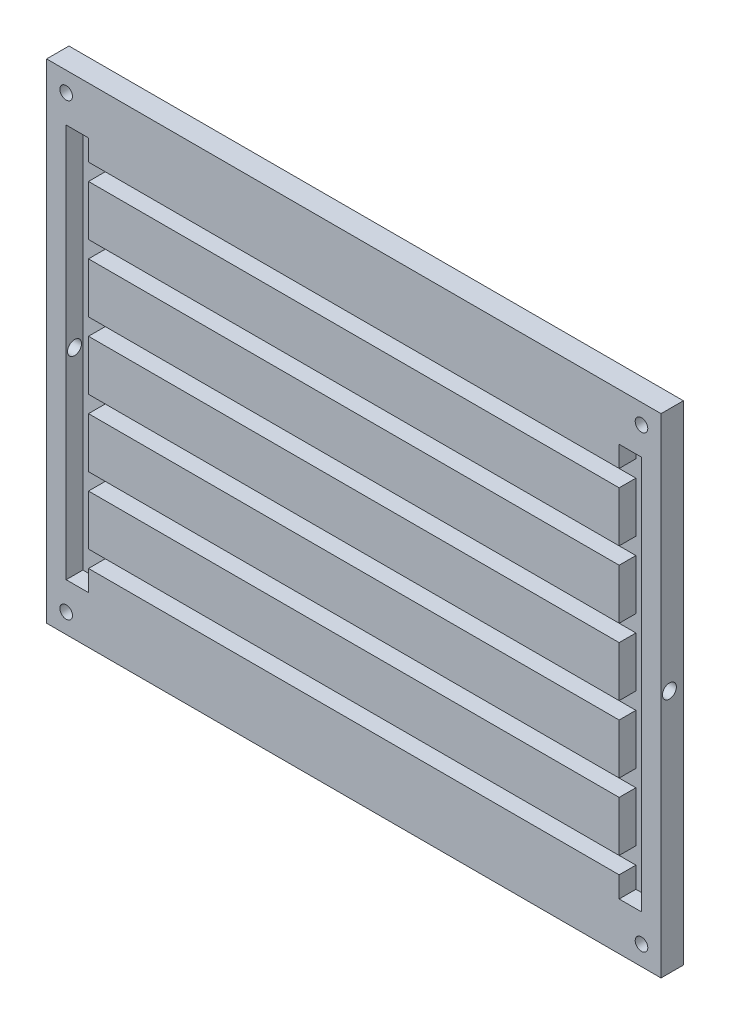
ISO-10303-21;
HEADER;
FILE_DESCRIPTION(('STEP AP214'),'2;1');
FILE_NAME('part.step','',(''),(''),'','','');
FILE_SCHEMA(('AUTOMOTIVE_DESIGN { 1 0 10303 214 1 1 1 1 }'));
ENDSEC;
DATA;
#1=APPLICATION_CONTEXT('core data for automotive mechanical design processes');
#2=APPLICATION_PROTOCOL_DEFINITION('international standard','automotive_design',2000,#1);
#3=PRODUCT_CONTEXT('',#1,'mechanical');
#4=PRODUCT('Part','Part','',(#3));
#5=PRODUCT_RELATED_PRODUCT_CATEGORY('part','',(#4));
#6=PRODUCT_DEFINITION_FORMATION('','',#4);
#7=PRODUCT_DEFINITION_CONTEXT('part definition',#1,'design');
#8=PRODUCT_DEFINITION('design','',#6,#7);
#9=PRODUCT_DEFINITION_SHAPE('','',#8);
#10=(LENGTH_UNIT() NAMED_UNIT(*) SI_UNIT(.MILLI.,.METRE.));
#11=(NAMED_UNIT(*) PLANE_ANGLE_UNIT() SI_UNIT($,.RADIAN.));
#12=(NAMED_UNIT(*) SI_UNIT($,.STERADIAN.) SOLID_ANGLE_UNIT());
#13=UNCERTAINTY_MEASURE_WITH_UNIT(LENGTH_MEASURE(1.E-05),#10,'distance_accuracy_value','');
#14=(GEOMETRIC_REPRESENTATION_CONTEXT(3) GLOBAL_UNCERTAINTY_ASSIGNED_CONTEXT((#13)) GLOBAL_UNIT_ASSIGNED_CONTEXT((#10,
#11,#12)) REPRESENTATION_CONTEXT('',''));
#15=CARTESIAN_POINT('',(0.,0.,0.));
#16=DIRECTION('',(0.,0.,1.));
#17=DIRECTION('',(1.,0.,0.));
#18=AXIS2_PLACEMENT_3D('',#15,#16,#17);
#19=CARTESIAN_POINT('',(0.,0.,8.));
#20=DIRECTION('',(0.,0.,-1.));
#21=DIRECTION('',(-1.,0.,0.));
#22=AXIS2_PLACEMENT_3D('',#19,#20,#21);
#23=PLANE('',#22);
#24=DIRECTION('',(0.,1.,0.));
#25=VECTOR('',#24,1.);
#26=CARTESIAN_POINT('',(15.,17.,8.));
#27=LINE('',#26,#25);
#28=CARTESIAN_POINT('',(15.,30.5,8.));
#29=VERTEX_POINT('',#28);
#30=CARTESIAN_POINT('',(15.,48.5,8.));
#31=VERTEX_POINT('',#30);
#32=EDGE_CURVE('E11',#29,#31,#27,.T.);
#33=ORIENTED_EDGE('',*,*,#32,.F.);
#34=DIRECTION('',(-1.,0.,0.));
#35=VECTOR('',#34,1.);
#36=CARTESIAN_POINT('',(15.,30.5,8.));
#37=LINE('',#36,#35);
#38=CARTESIAN_POINT('',(205.,30.5,8.));
#39=VERTEX_POINT('',#38);
#40=EDGE_CURVE('E393',#39,#29,#37,.T.);
#41=ORIENTED_EDGE('',*,*,#40,.F.);
#42=DIRECTION('',(0.,-1.,0.));
#43=VECTOR('',#42,1.);
#44=CARTESIAN_POINT('',(205.,17.,8.));
#45=LINE('',#44,#43);
#46=CARTESIAN_POINT('',(205.,48.5,8.));
#47=VERTEX_POINT('',#46);
#48=EDGE_CURVE('E608',#47,#39,#45,.T.);
#49=ORIENTED_EDGE('',*,*,#48,.F.);
#50=DIRECTION('',(1.,0.,0.));
#51=VECTOR('',#50,1.);
#52=CARTESIAN_POINT('',(14.9999999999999,48.5,8.));
#53=LINE('',#52,#51);
#54=EDGE_CURVE('E432',#31,#47,#53,.T.);
#55=ORIENTED_EDGE('',*,*,#54,.F.);
#56=EDGE_LOOP('',(#33,#41,#49,#55));
#57=FACE_BOUND('',#56,.T.);
#58=ADVANCED_FACE('F46',(#57),#23,.F.);
#59=CARTESIAN_POINT('',(15.,54.5,8.));
#60=VERTEX_POINT('',#59);
#61=CARTESIAN_POINT('',(15.,72.5,8.));
#62=VERTEX_POINT('',#61);
#63=EDGE_CURVE('E57',#60,#62,#27,.T.);
#64=ORIENTED_EDGE('',*,*,#63,.F.);
#65=DIRECTION('',(-1.,0.,0.));
#66=VECTOR('',#65,1.);
#67=CARTESIAN_POINT('',(14.9999999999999,54.5,8.));
#68=LINE('',#67,#66);
#69=CARTESIAN_POINT('',(205.,54.5,8.));
#70=VERTEX_POINT('',#69);
#71=EDGE_CURVE('E398',#70,#60,#68,.T.);
#72=ORIENTED_EDGE('',*,*,#71,.F.);
#73=CARTESIAN_POINT('',(205.,72.5,8.));
#74=VERTEX_POINT('',#73);
#75=EDGE_CURVE('E619',#74,#70,#45,.T.);
#76=ORIENTED_EDGE('',*,*,#75,.F.);
#77=DIRECTION('',(1.,0.,0.));
#78=VECTOR('',#77,1.);
#79=CARTESIAN_POINT('',(14.9999999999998,72.5,8.));
#80=LINE('',#79,#78);
#81=EDGE_CURVE('E464',#62,#74,#80,.T.);
#82=ORIENTED_EDGE('',*,*,#81,.F.);
#83=EDGE_LOOP('',(#64,#72,#76,#82));
#84=FACE_BOUND('',#83,.T.);
#85=ADVANCED_FACE('F657',(#84),#23,.F.);
#86=CARTESIAN_POINT('',(15.,78.5,8.));
#87=VERTEX_POINT('',#86);
#88=CARTESIAN_POINT('',(15.,96.5,8.));
#89=VERTEX_POINT('',#88);
#90=EDGE_CURVE('E640',#87,#89,#27,.T.);
#91=ORIENTED_EDGE('',*,*,#90,.F.);
#92=DIRECTION('',(-1.,0.,0.));
#93=VECTOR('',#92,1.);
#94=CARTESIAN_POINT('',(14.9999999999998,78.5,8.));
#95=LINE('',#94,#93);
#96=CARTESIAN_POINT('',(205.,78.5,8.));
#97=VERTEX_POINT('',#96);
#98=EDGE_CURVE('E433',#97,#87,#95,.T.);
#99=ORIENTED_EDGE('',*,*,#98,.F.);
#100=CARTESIAN_POINT('',(205.,96.5,8.));
#101=VERTEX_POINT('',#100);
#102=EDGE_CURVE('E622',#101,#97,#45,.T.);
#103=ORIENTED_EDGE('',*,*,#102,.F.);
#104=DIRECTION('',(1.,0.,0.));
#105=VECTOR('',#104,1.);
#106=CARTESIAN_POINT('',(14.9999999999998,96.5,8.));
#107=LINE('',#106,#105);
#108=EDGE_CURVE('E493',#89,#101,#107,.T.);
#109=ORIENTED_EDGE('',*,*,#108,.F.);
#110=EDGE_LOOP('',(#91,#99,#103,#109));
#111=FACE_BOUND('',#110,.T.);
#112=ADVANCED_FACE('F729',(#111),#23,.F.);
#113=CARTESIAN_POINT('',(15.,102.5,8.));
#114=VERTEX_POINT('',#113);
#115=CARTESIAN_POINT('',(15.,120.5,8.));
#116=VERTEX_POINT('',#115);
#117=EDGE_CURVE('E633',#114,#116,#27,.T.);
#118=ORIENTED_EDGE('',*,*,#117,.F.);
#119=DIRECTION('',(-1.,0.,0.));
#120=VECTOR('',#119,1.);
#121=CARTESIAN_POINT('',(14.9999999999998,102.5,8.));
#122=LINE('',#121,#120);
#123=CARTESIAN_POINT('',(205.,102.5,8.));
#124=VERTEX_POINT('',#123);
#125=EDGE_CURVE('E461',#124,#114,#122,.T.);
#126=ORIENTED_EDGE('',*,*,#125,.F.);
#127=CARTESIAN_POINT('',(205.,120.5,8.));
#128=VERTEX_POINT('',#127);
#129=EDGE_CURVE('E623',#128,#124,#45,.T.);
#130=ORIENTED_EDGE('',*,*,#129,.F.);
#131=DIRECTION('',(1.,0.,0.));
#132=VECTOR('',#131,1.);
#133=CARTESIAN_POINT('',(14.9999999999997,120.5,8.));
#134=LINE('',#133,#132);
#135=EDGE_CURVE('E521',#116,#128,#134,.T.);
#136=ORIENTED_EDGE('',*,*,#135,.F.);
#137=EDGE_LOOP('',(#118,#126,#130,#136));
#138=FACE_BOUND('',#137,.T.);
#139=ADVANCED_FACE('F744',(#138),#23,.F.);
#140=CARTESIAN_POINT('',(15.,126.5,8.));
#141=VERTEX_POINT('',#140);
#142=CARTESIAN_POINT('',(15.,144.5,8.));
#143=VERTEX_POINT('',#142);
#144=EDGE_CURVE('E612',#141,#143,#27,.T.);
#145=ORIENTED_EDGE('',*,*,#144,.F.);
#146=DIRECTION('',(-1.,0.,0.));
#147=VECTOR('',#146,1.);
#148=CARTESIAN_POINT('',(14.9999999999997,126.5,8.));
#149=LINE('',#148,#147);
#150=CARTESIAN_POINT('',(205.,126.5,8.));
#151=VERTEX_POINT('',#150);
#152=EDGE_CURVE('E492',#151,#141,#149,.T.);
#153=ORIENTED_EDGE('',*,*,#152,.F.);
#154=CARTESIAN_POINT('',(205.,144.5,8.));
#155=VERTEX_POINT('',#154);
#156=EDGE_CURVE('E369',#155,#151,#45,.T.);
#157=ORIENTED_EDGE('',*,*,#156,.F.);
#158=DIRECTION('',(1.,0.,0.));
#159=VECTOR('',#158,1.);
#160=CARTESIAN_POINT('',(14.9999999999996,144.5,8.));
#161=LINE('',#160,#159);
#162=EDGE_CURVE('E555',#143,#155,#161,.T.);
#163=ORIENTED_EDGE('',*,*,#162,.F.);
#164=EDGE_LOOP('',(#145,#153,#157,#163));
#165=FACE_BOUND('',#164,.T.);
#166=ADVANCED_FACE('F735',(#165),#23,.F.);
#167=CARTESIAN_POINT('',(213.,7.,8.));
#168=DIRECTION('',(0.,0.,1.));
#169=DIRECTION('',(1.,0.,0.));
#170=AXIS2_PLACEMENT_3D('',#167,#168,#169);
#171=CIRCLE('',#170,2.25000000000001);
#172=CARTESIAN_POINT('',(215.25,7.,8.));
#173=VERTEX_POINT('',#172);
#174=EDGE_CURVE('E747',#173,#173,#171,.T.);
#175=ORIENTED_EDGE('',*,*,#174,.F.);
#176=EDGE_LOOP('',(#175));
#177=FACE_BOUND('',#176,.T.);
#178=CARTESIAN_POINT('',(7.,7.,8.));
#179=DIRECTION('',(0.,0.,1.));
#180=DIRECTION('',(1.,0.,0.));
#181=AXIS2_PLACEMENT_3D('',#178,#179,#180);
#182=CIRCLE('',#181,2.25);
#183=CARTESIAN_POINT('',(9.25,7.,8.));
#184=VERTEX_POINT('',#183);
#185=EDGE_CURVE('E753',#184,#184,#182,.T.);
#186=ORIENTED_EDGE('',*,*,#185,.F.);
#187=EDGE_LOOP('',(#186));
#188=FACE_BOUND('',#187,.T.);
#189=CARTESIAN_POINT('',(7.,168.,8.));
#190=DIRECTION('',(0.,0.,1.));
#191=DIRECTION('',(1.,0.,0.));
#192=AXIS2_PLACEMENT_3D('',#189,#190,#191);
#193=CIRCLE('',#192,2.25);
#194=CARTESIAN_POINT('',(9.25,168.,8.));
#195=VERTEX_POINT('',#194);
#196=EDGE_CURVE('E752',#195,#195,#193,.T.);
#197=ORIENTED_EDGE('',*,*,#196,.F.);
#198=EDGE_LOOP('',(#197));
#199=FACE_BOUND('',#198,.T.);
#200=CARTESIAN_POINT('',(213.,168.,8.));
#201=DIRECTION('',(0.,0.,1.));
#202=DIRECTION('',(1.,0.,0.));
#203=AXIS2_PLACEMENT_3D('',#200,#201,#202);
#204=CIRCLE('',#203,2.25000000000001);
#205=CARTESIAN_POINT('',(215.25,168.,8.));
#206=VERTEX_POINT('',#205);
#207=EDGE_CURVE('E757',#206,#206,#204,.T.);
#208=ORIENTED_EDGE('',*,*,#207,.F.);
#209=EDGE_LOOP('',(#208));
#210=FACE_BOUND('',#209,.T.);
#211=DIRECTION('',(0.,-1.,0.));
#212=VECTOR('',#211,1.);
#213=CARTESIAN_POINT('',(0.,0.,8.));
#214=LINE('',#213,#212);
#215=CARTESIAN_POINT('',(0.,175.,8.));
#216=VERTEX_POINT('',#215);
#217=CARTESIAN_POINT('',(0.,0.,8.));
#218=VERTEX_POINT('',#217);
#219=EDGE_CURVE('E567',#216,#218,#214,.T.);
#220=ORIENTED_EDGE('',*,*,#219,.T.);
#221=DIRECTION('',(1.,0.,0.));
#222=VECTOR('',#221,1.);
#223=CARTESIAN_POINT('',(0.,0.,8.));
#224=LINE('',#223,#222);
#225=CARTESIAN_POINT('',(220.,0.,8.));
#226=VERTEX_POINT('',#225);
#227=EDGE_CURVE('E568',#218,#226,#224,.T.);
#228=ORIENTED_EDGE('',*,*,#227,.T.);
#229=DIRECTION('',(0.,1.,0.));
#230=VECTOR('',#229,1.);
#231=CARTESIAN_POINT('',(220.,0.,8.));
#232=LINE('',#231,#230);
#233=CARTESIAN_POINT('',(220.,175.,8.));
#234=VERTEX_POINT('',#233);
#235=EDGE_CURVE('E574',#226,#234,#232,.T.);
#236=ORIENTED_EDGE('',*,*,#235,.T.);
#237=DIRECTION('',(-1.,0.,0.));
#238=VECTOR('',#237,1.);
#239=CARTESIAN_POINT('',(0.,175.,8.));
#240=LINE('',#239,#238);
#241=EDGE_CURVE('E579',#234,#216,#240,.T.);
#242=ORIENTED_EDGE('',*,*,#241,.T.);
#243=EDGE_LOOP('',(#220,#228,#236,#242));
#244=FACE_BOUND('',#243,.T.);
#245=CARTESIAN_POINT('',(205.,158.,8.));
#246=VERTEX_POINT('',#245);
#247=CARTESIAN_POINT('',(205.,150.5,8.));
#248=VERTEX_POINT('',#247);
#249=EDGE_CURVE('E330',#246,#248,#45,.T.);
#250=ORIENTED_EDGE('',*,*,#249,.F.);
#251=DIRECTION('',(-1.,0.,0.));
#252=VECTOR('',#251,1.);
#253=CARTESIAN_POINT('',(205.,158.,8.));
#254=LINE('',#253,#252);
#255=CARTESIAN_POINT('',(213.,158.,8.));
#256=VERTEX_POINT('',#255);
#257=EDGE_CURVE('E352',#256,#246,#254,.T.);
#258=ORIENTED_EDGE('',*,*,#257,.F.);
#259=DIRECTION('',(0.,1.,0.));
#260=VECTOR('',#259,1.);
#261=CARTESIAN_POINT('',(213.,17.,8.));
#262=LINE('',#261,#260);
#263=CARTESIAN_POINT('',(213.,17.,8.));
#264=VERTEX_POINT('',#263);
#265=EDGE_CURVE('E356',#264,#256,#262,.T.);
#266=ORIENTED_EDGE('',*,*,#265,.F.);
#267=DIRECTION('',(1.,0.,0.));
#268=VECTOR('',#267,1.);
#269=CARTESIAN_POINT('',(205.,17.,8.));
#270=LINE('',#269,#268);
#271=CARTESIAN_POINT('',(205.,17.,8.));
#272=VERTEX_POINT('',#271);
#273=EDGE_CURVE('E365',#272,#264,#270,.T.);
#274=ORIENTED_EDGE('',*,*,#273,.F.);
#275=CARTESIAN_POINT('',(205.,24.5,8.));
#276=VERTEX_POINT('',#275);
#277=EDGE_CURVE('E367',#276,#272,#45,.T.);
#278=ORIENTED_EDGE('',*,*,#277,.F.);
#279=DIRECTION('',(1.,0.,0.));
#280=VECTOR('',#279,1.);
#281=CARTESIAN_POINT('',(15.,24.5,8.));
#282=LINE('',#281,#280);
#283=CARTESIAN_POINT('',(15.,24.5,8.));
#284=VERTEX_POINT('',#283);
#285=EDGE_CURVE('E397',#284,#276,#282,.T.);
#286=ORIENTED_EDGE('',*,*,#285,.F.);
#287=CARTESIAN_POINT('',(15.,17.,8.));
#288=VERTEX_POINT('',#287);
#289=EDGE_CURVE('E59',#288,#284,#27,.T.);
#290=ORIENTED_EDGE('',*,*,#289,.F.);
#291=DIRECTION('',(1.,0.,0.));
#292=VECTOR('',#291,1.);
#293=CARTESIAN_POINT('',(7.,17.,8.));
#294=LINE('',#293,#292);
#295=CARTESIAN_POINT('',(7.,17.,8.));
#296=VERTEX_POINT('',#295);
#297=EDGE_CURVE('E326',#296,#288,#294,.T.);
#298=ORIENTED_EDGE('',*,*,#297,.F.);
#299=DIRECTION('',(0.,-1.,0.));
#300=VECTOR('',#299,1.);
#301=CARTESIAN_POINT('',(7.,17.,8.));
#302=LINE('',#301,#300);
#303=CARTESIAN_POINT('',(7.,158.,8.));
#304=VERTEX_POINT('',#303);
#305=EDGE_CURVE('E62',#304,#296,#302,.T.);
#306=ORIENTED_EDGE('',*,*,#305,.F.);
#307=DIRECTION('',(-1.,0.,0.));
#308=VECTOR('',#307,1.);
#309=CARTESIAN_POINT('',(7.,158.,8.));
#310=LINE('',#309,#308);
#311=CARTESIAN_POINT('',(15.,158.,8.));
#312=VERTEX_POINT('',#311);
#313=EDGE_CURVE('E310',#312,#304,#310,.T.);
#314=ORIENTED_EDGE('',*,*,#313,.F.);
#315=CARTESIAN_POINT('',(15.,150.5,8.));
#316=VERTEX_POINT('',#315);
#317=EDGE_CURVE('E329',#316,#312,#27,.T.);
#318=ORIENTED_EDGE('',*,*,#317,.F.);
#319=DIRECTION('',(-1.,0.,0.));
#320=VECTOR('',#319,1.);
#321=CARTESIAN_POINT('',(14.9999999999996,150.5,8.));
#322=LINE('',#321,#320);
#323=EDGE_CURVE('E525',#248,#316,#322,.T.);
#324=ORIENTED_EDGE('',*,*,#323,.F.);
#325=EDGE_LOOP('',(#250,#258,#266,#274,#278,#286,#290,#298,#306,#314,#318,#324));
#326=FACE_BOUND('',#325,.T.);
#327=ADVANCED_FACE('F702',(#177,#188,#199,#210,#244,#326),#23,.F.);
#328=CARTESIAN_POINT('',(0.,0.,8.));
#329=DIRECTION('',(1.,0.,0.));
#330=DIRECTION('',(0.,0.,-1.));
#331=AXIS2_PLACEMENT_3D('',#328,#329,#330);
#332=PLANE('',#331);
#333=CARTESIAN_POINT('',(0.,87.4942855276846,5.));
#334=DIRECTION('',(-1.,0.,0.));
#335=DIRECTION('',(0.,0.,1.));
#336=AXIS2_PLACEMENT_3D('',#333,#334,#335);
#337=CIRCLE('',#336,2.5);
#338=CARTESIAN_POINT('',(0.,87.4942855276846,7.5));
#339=VERTEX_POINT('',#338);
#340=EDGE_CURVE('E312',#339,#339,#337,.T.);
#341=ORIENTED_EDGE('',*,*,#340,.F.);
#342=EDGE_LOOP('',(#341));
#343=FACE_BOUND('',#342,.T.);
#344=DIRECTION('',(0.,-1.,0.));
#345=VECTOR('',#344,1.);
#346=CARTESIAN_POINT('',(0.,0.,0.));
#347=LINE('',#346,#345);
#348=CARTESIAN_POINT('',(0.,175.,0.));
#349=VERTEX_POINT('',#348);
#350=CARTESIAN_POINT('',(0.,0.,0.));
#351=VERTEX_POINT('',#350);
#352=EDGE_CURVE('E410',#349,#351,#347,.T.);
#353=ORIENTED_EDGE('',*,*,#352,.T.);
#354=DIRECTION('',(0.,0.,-1.));
#355=VECTOR('',#354,1.);
#356=CARTESIAN_POINT('',(0.,0.,8.));
#357=LINE('',#356,#355);
#358=EDGE_CURVE('E49',#218,#351,#357,.T.);
#359=ORIENTED_EDGE('',*,*,#358,.F.);
#360=ORIENTED_EDGE('',*,*,#219,.F.);
#361=DIRECTION('',(0.,0.,-1.));
#362=VECTOR('',#361,1.);
#363=CARTESIAN_POINT('',(0.,175.,8.));
#364=LINE('',#363,#362);
#365=EDGE_CURVE('E578',#216,#349,#364,.T.);
#366=ORIENTED_EDGE('',*,*,#365,.T.);
#367=EDGE_LOOP('',(#353,#359,#360,#366));
#368=FACE_BOUND('',#367,.T.);
#369=ADVANCED_FACE('F48',(#343,#368),#332,.F.);
#370=CARTESIAN_POINT('',(0.,0.,8.));
#371=DIRECTION('',(0.,1.,0.));
#372=DIRECTION('',(0.,0.,1.));
#373=AXIS2_PLACEMENT_3D('',#370,#371,#372);
#374=PLANE('',#373);
#375=DIRECTION('',(1.,0.,0.));
#376=VECTOR('',#375,1.);
#377=CARTESIAN_POINT('',(0.,0.,0.));
#378=LINE('',#377,#376);
#379=CARTESIAN_POINT('',(220.,0.,0.));
#380=VERTEX_POINT('',#379);
#381=EDGE_CURVE('E585',#351,#380,#378,.T.);
#382=ORIENTED_EDGE('',*,*,#381,.T.);
#383=DIRECTION('',(0.,0.,-1.));
#384=VECTOR('',#383,1.);
#385=CARTESIAN_POINT('',(220.,0.,8.));
#386=LINE('',#385,#384);
#387=EDGE_CURVE('E598',#226,#380,#386,.T.);
#388=ORIENTED_EDGE('',*,*,#387,.F.);
#389=ORIENTED_EDGE('',*,*,#227,.F.);
#390=ORIENTED_EDGE('',*,*,#358,.T.);
#391=EDGE_LOOP('',(#382,#388,#389,#390));
#392=FACE_BOUND('',#391,.T.);
#393=ADVANCED_FACE('F739',(#392),#374,.F.);
#394=CARTESIAN_POINT('',(220.,0.,8.));
#395=DIRECTION('',(-1.,0.,0.));
#396=DIRECTION('',(0.,0.,1.));
#397=AXIS2_PLACEMENT_3D('',#394,#395,#396);
#398=PLANE('',#397);
#399=CARTESIAN_POINT('',(220.,87.5,5.));
#400=DIRECTION('',(1.,0.,0.));
#401=DIRECTION('',(0.,0.,-1.));
#402=AXIS2_PLACEMENT_3D('',#399,#400,#401);
#403=CIRCLE('',#402,2.5);
#404=CARTESIAN_POINT('',(220.,87.5,2.5));
#405=VERTEX_POINT('',#404);
#406=EDGE_CURVE('E1172',#405,#405,#403,.T.);
#407=ORIENTED_EDGE('',*,*,#406,.F.);
#408=EDGE_LOOP('',(#407));
#409=FACE_BOUND('',#408,.T.);
#410=DIRECTION('',(0.,1.,0.));
#411=VECTOR('',#410,1.);
#412=CARTESIAN_POINT('',(220.,0.,0.));
#413=LINE('',#412,#411);
#414=CARTESIAN_POINT('',(220.,175.,0.));
#415=VERTEX_POINT('',#414);
#416=EDGE_CURVE('E590',#380,#415,#413,.T.);
#417=ORIENTED_EDGE('',*,*,#416,.T.);
#418=DIRECTION('',(0.,0.,-1.));
#419=VECTOR('',#418,1.);
#420=CARTESIAN_POINT('',(220.,175.,8.));
#421=LINE('',#420,#419);
#422=EDGE_CURVE('E594',#234,#415,#421,.T.);
#423=ORIENTED_EDGE('',*,*,#422,.F.);
#424=ORIENTED_EDGE('',*,*,#235,.F.);
#425=ORIENTED_EDGE('',*,*,#387,.T.);
#426=EDGE_LOOP('',(#417,#423,#424,#425));
#427=FACE_BOUND('',#426,.T.);
#428=ADVANCED_FACE('F768',(#409,#427),#398,.F.);
#429=CARTESIAN_POINT('',(0.,175.,8.));
#430=DIRECTION('',(0.,-1.,0.));
#431=DIRECTION('',(0.,0.,-1.));
#432=AXIS2_PLACEMENT_3D('',#429,#430,#431);
#433=PLANE('',#432);
#434=DIRECTION('',(-1.,0.,0.));
#435=VECTOR('',#434,1.);
#436=CARTESIAN_POINT('',(0.,175.,0.));
#437=LINE('',#436,#435);
#438=EDGE_CURVE('E573',#415,#349,#437,.T.);
#439=ORIENTED_EDGE('',*,*,#438,.T.);
#440=ORIENTED_EDGE('',*,*,#365,.F.);
#441=ORIENTED_EDGE('',*,*,#241,.F.);
#442=ORIENTED_EDGE('',*,*,#422,.T.);
#443=EDGE_LOOP('',(#439,#440,#441,#442));
#444=FACE_BOUND('',#443,.T.);
#445=ADVANCED_FACE('F772',(#444),#433,.F.);
#446=CARTESIAN_POINT('',(0.,0.,0.));
#447=DIRECTION('',(0.,0.,-1.));
#448=DIRECTION('',(-1.,0.,0.));
#449=AXIS2_PLACEMENT_3D('',#446,#447,#448);
#450=PLANE('',#449);
#451=CARTESIAN_POINT('',(213.,7.,0.));
#452=DIRECTION('',(0.,0.,1.));
#453=DIRECTION('',(1.,0.,0.));
#454=AXIS2_PLACEMENT_3D('',#451,#452,#453);
#455=CIRCLE('',#454,2.25000000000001);
#456=CARTESIAN_POINT('',(215.25,7.,0.));
#457=VERTEX_POINT('',#456);
#458=EDGE_CURVE('E1157',#457,#457,#455,.T.);
#459=ORIENTED_EDGE('',*,*,#458,.T.);
#460=EDGE_LOOP('',(#459));
#461=FACE_BOUND('',#460,.T.);
#462=CARTESIAN_POINT('',(7.,7.,0.));
#463=DIRECTION('',(0.,0.,1.));
#464=DIRECTION('',(1.,0.,0.));
#465=AXIS2_PLACEMENT_3D('',#462,#463,#464);
#466=CIRCLE('',#465,2.25);
#467=CARTESIAN_POINT('',(9.25,7.,0.));
#468=VERTEX_POINT('',#467);
#469=EDGE_CURVE('E1159',#468,#468,#466,.T.);
#470=ORIENTED_EDGE('',*,*,#469,.T.);
#471=EDGE_LOOP('',(#470));
#472=FACE_BOUND('',#471,.T.);
#473=CARTESIAN_POINT('',(7.,168.,0.));
#474=DIRECTION('',(0.,0.,1.));
#475=DIRECTION('',(1.,0.,0.));
#476=AXIS2_PLACEMENT_3D('',#473,#474,#475);
#477=CIRCLE('',#476,2.25);
#478=CARTESIAN_POINT('',(9.25,168.,0.));
#479=VERTEX_POINT('',#478);
#480=EDGE_CURVE('E1190',#479,#479,#477,.T.);
#481=ORIENTED_EDGE('',*,*,#480,.T.);
#482=EDGE_LOOP('',(#481));
#483=FACE_BOUND('',#482,.T.);
#484=CARTESIAN_POINT('',(213.,168.,0.));
#485=DIRECTION('',(0.,0.,1.));
#486=DIRECTION('',(1.,0.,0.));
#487=AXIS2_PLACEMENT_3D('',#484,#485,#486);
#488=CIRCLE('',#487,2.25000000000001);
#489=CARTESIAN_POINT('',(215.25,168.,0.));
#490=VERTEX_POINT('',#489);
#491=EDGE_CURVE('E1169',#490,#490,#488,.T.);
#492=ORIENTED_EDGE('',*,*,#491,.T.);
#493=EDGE_LOOP('',(#492));
#494=FACE_BOUND('',#493,.T.);
#495=ORIENTED_EDGE('',*,*,#352,.F.);
#496=ORIENTED_EDGE('',*,*,#438,.F.);
#497=ORIENTED_EDGE('',*,*,#416,.F.);
#498=ORIENTED_EDGE('',*,*,#381,.F.);
#499=EDGE_LOOP('',(#495,#496,#497,#498));
#500=FACE_BOUND('',#499,.T.);
#501=ADVANCED_FACE('F770',(#461,#472,#483,#494,#500),#450,.T.);
#502=CARTESIAN_POINT('',(14.9999999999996,150.5,2.));
#503=DIRECTION('',(0.,1.,0.));
#504=DIRECTION('',(0.,0.,1.));
#505=AXIS2_PLACEMENT_3D('',#502,#503,#504);
#506=PLANE('',#505);
#507=ORIENTED_EDGE('',*,*,#323,.T.);
#508=DIRECTION('',(0.,0.,1.));
#509=VECTOR('',#508,1.);
#510=CARTESIAN_POINT('',(14.9999999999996,150.5,2.));
#511=LINE('',#510,#509);
#512=CARTESIAN_POINT('',(15.,150.5,2.));
#513=VERTEX_POINT('',#512);
#514=EDGE_CURVE('E538',#513,#316,#511,.T.);
#515=ORIENTED_EDGE('',*,*,#514,.F.);
#516=DIRECTION('',(-1.,0.,0.));
#517=VECTOR('',#516,1.);
#518=CARTESIAN_POINT('',(14.9999999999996,150.5,2.));
#519=LINE('',#518,#517);
#520=CARTESIAN_POINT('',(205.,150.5,2.));
#521=VERTEX_POINT('',#520);
#522=EDGE_CURVE('E558',#521,#513,#519,.T.);
#523=ORIENTED_EDGE('',*,*,#522,.F.);
#524=DIRECTION('',(0.,0.,1.));
#525=VECTOR('',#524,1.);
#526=CARTESIAN_POINT('',(205.,150.5,2.));
#527=LINE('',#526,#525);
#528=EDGE_CURVE('E333',#521,#248,#527,.T.);
#529=ORIENTED_EDGE('',*,*,#528,.T.);
#530=EDGE_LOOP('',(#507,#515,#523,#529));
#531=FACE_BOUND('',#530,.T.);
#532=ADVANCED_FACE('F698',(#531),#506,.F.);
#533=CARTESIAN_POINT('',(14.9999999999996,144.5,2.));
#534=DIRECTION('',(0.,-1.,0.));
#535=DIRECTION('',(0.,0.,-1.));
#536=AXIS2_PLACEMENT_3D('',#533,#534,#535);
#537=PLANE('',#536);
#538=ORIENTED_EDGE('',*,*,#162,.T.);
#539=DIRECTION('',(0.,0.,1.));
#540=VECTOR('',#539,1.);
#541=CARTESIAN_POINT('',(205.,144.5,2.));
#542=LINE('',#541,#540);
#543=CARTESIAN_POINT('',(205.,144.5,2.));
#544=VERTEX_POINT('',#543);
#545=EDGE_CURVE('E546',#544,#155,#542,.T.);
#546=ORIENTED_EDGE('',*,*,#545,.F.);
#547=DIRECTION('',(1.,0.,0.));
#548=VECTOR('',#547,1.);
#549=CARTESIAN_POINT('',(14.9999999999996,144.5,2.));
#550=LINE('',#549,#548);
#551=CARTESIAN_POINT('',(15.,144.5,2.));
#552=VERTEX_POINT('',#551);
#553=EDGE_CURVE('E541',#552,#544,#550,.T.);
#554=ORIENTED_EDGE('',*,*,#553,.F.);
#555=DIRECTION('',(0.,0.,1.));
#556=VECTOR('',#555,1.);
#557=CARTESIAN_POINT('',(14.9999999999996,144.5,2.));
#558=LINE('',#557,#556);
#559=EDGE_CURVE('E545',#552,#143,#558,.T.);
#560=ORIENTED_EDGE('',*,*,#559,.T.);
#561=EDGE_LOOP('',(#538,#546,#554,#560));
#562=FACE_BOUND('',#561,.T.);
#563=ADVANCED_FACE('F814',(#562),#537,.F.);
#564=CARTESIAN_POINT('',(14.9999999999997,126.5,2.));
#565=DIRECTION('',(0.,1.,0.));
#566=DIRECTION('',(0.,0.,1.));
#567=AXIS2_PLACEMENT_3D('',#564,#565,#566);
#568=PLANE('',#567);
#569=ORIENTED_EDGE('',*,*,#152,.T.);
#570=DIRECTION('',(0.,0.,1.));
#571=VECTOR('',#570,1.);
#572=CARTESIAN_POINT('',(14.9999999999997,126.5,2.));
#573=LINE('',#572,#571);
#574=CARTESIAN_POINT('',(15.,126.5,2.));
#575=VERTEX_POINT('',#574);
#576=EDGE_CURVE('E510',#575,#141,#573,.T.);
#577=ORIENTED_EDGE('',*,*,#576,.F.);
#578=DIRECTION('',(-1.,0.,0.));
#579=VECTOR('',#578,1.);
#580=CARTESIAN_POINT('',(14.9999999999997,126.5,2.));
#581=LINE('',#580,#579);
#582=CARTESIAN_POINT('',(205.,126.5,2.));
#583=VERTEX_POINT('',#582);
#584=EDGE_CURVE('E526',#583,#575,#581,.T.);
#585=ORIENTED_EDGE('',*,*,#584,.F.);
#586=DIRECTION('',(0.,0.,1.));
#587=VECTOR('',#586,1.);
#588=CARTESIAN_POINT('',(205.,126.5,2.));
#589=LINE('',#588,#587);
#590=EDGE_CURVE('E519',#583,#151,#589,.T.);
#591=ORIENTED_EDGE('',*,*,#590,.T.);
#592=EDGE_LOOP('',(#569,#577,#585,#591));
#593=FACE_BOUND('',#592,.T.);
#594=ADVANCED_FACE('F823',(#593),#568,.F.);
#595=CARTESIAN_POINT('',(14.9999999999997,120.5,2.));
#596=DIRECTION('',(0.,-1.,0.));
#597=DIRECTION('',(0.,0.,-1.));
#598=AXIS2_PLACEMENT_3D('',#595,#596,#597);
#599=PLANE('',#598);
#600=ORIENTED_EDGE('',*,*,#135,.T.);
#601=DIRECTION('',(0.,0.,1.));
#602=VECTOR('',#601,1.);
#603=CARTESIAN_POINT('',(205.,120.5,2.));
#604=LINE('',#603,#602);
#605=CARTESIAN_POINT('',(205.,120.5,2.));
#606=VERTEX_POINT('',#605);
#607=EDGE_CURVE('E518',#606,#128,#604,.T.);
#608=ORIENTED_EDGE('',*,*,#607,.F.);
#609=DIRECTION('',(1.,0.,0.));
#610=VECTOR('',#609,1.);
#611=CARTESIAN_POINT('',(14.9999999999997,120.5,2.));
#612=LINE('',#611,#610);
#613=CARTESIAN_POINT('',(15.,120.5,2.));
#614=VERTEX_POINT('',#613);
#615=EDGE_CURVE('E512',#614,#606,#612,.T.);
#616=ORIENTED_EDGE('',*,*,#615,.F.);
#617=DIRECTION('',(0.,0.,1.));
#618=VECTOR('',#617,1.);
#619=CARTESIAN_POINT('',(14.9999999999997,120.5,2.));
#620=LINE('',#619,#618);
#621=EDGE_CURVE('E515',#614,#116,#620,.T.);
#622=ORIENTED_EDGE('',*,*,#621,.T.);
#623=EDGE_LOOP('',(#600,#608,#616,#622));
#624=FACE_BOUND('',#623,.T.);
#625=ADVANCED_FACE('F831',(#624),#599,.F.);
#626=CARTESIAN_POINT('',(14.9999999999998,102.5,2.));
#627=DIRECTION('',(0.,1.,0.));
#628=DIRECTION('',(0.,0.,1.));
#629=AXIS2_PLACEMENT_3D('',#626,#627,#628);
#630=PLANE('',#629);
#631=ORIENTED_EDGE('',*,*,#125,.T.);
#632=DIRECTION('',(0.,0.,1.));
#633=VECTOR('',#632,1.);
#634=CARTESIAN_POINT('',(14.9999999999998,102.5,2.));
#635=LINE('',#634,#633);
#636=CARTESIAN_POINT('',(15.,102.5,2.));
#637=VERTEX_POINT('',#636);
#638=EDGE_CURVE('E476',#637,#114,#635,.T.);
#639=ORIENTED_EDGE('',*,*,#638,.F.);
#640=DIRECTION('',(-1.,0.,0.));
#641=VECTOR('',#640,1.);
#642=CARTESIAN_POINT('',(14.9999999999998,102.5,2.));
#643=LINE('',#642,#641);
#644=CARTESIAN_POINT('',(205.,102.5,2.));
#645=VERTEX_POINT('',#644);
#646=EDGE_CURVE('E499',#645,#637,#643,.T.);
#647=ORIENTED_EDGE('',*,*,#646,.F.);
#648=DIRECTION('',(0.,0.,1.));
#649=VECTOR('',#648,1.);
#650=CARTESIAN_POINT('',(205.,102.5,2.));
#651=LINE('',#650,#649);
#652=EDGE_CURVE('E487',#645,#124,#651,.T.);
#653=ORIENTED_EDGE('',*,*,#652,.T.);
#654=EDGE_LOOP('',(#631,#639,#647,#653));
#655=FACE_BOUND('',#654,.T.);
#656=ADVANCED_FACE('F841',(#655),#630,.F.);
#657=CARTESIAN_POINT('',(14.9999999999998,96.5,2.));
#658=DIRECTION('',(0.,-1.,0.));
#659=DIRECTION('',(0.,0.,-1.));
#660=AXIS2_PLACEMENT_3D('',#657,#658,#659);
#661=PLANE('',#660);
#662=ORIENTED_EDGE('',*,*,#108,.T.);
#663=DIRECTION('',(0.,0.,1.));
#664=VECTOR('',#663,1.);
#665=CARTESIAN_POINT('',(205.,96.5,2.));
#666=LINE('',#665,#664);
#667=CARTESIAN_POINT('',(205.,96.5,2.));
#668=VERTEX_POINT('',#667);
#669=EDGE_CURVE('E486',#668,#101,#666,.T.);
#670=ORIENTED_EDGE('',*,*,#669,.F.);
#671=DIRECTION('',(1.,0.,0.));
#672=VECTOR('',#671,1.);
#673=CARTESIAN_POINT('',(14.9999999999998,96.5,2.));
#674=LINE('',#673,#672);
#675=CARTESIAN_POINT('',(15.,96.5,2.));
#676=VERTEX_POINT('',#675);
#677=EDGE_CURVE('E481',#676,#668,#674,.T.);
#678=ORIENTED_EDGE('',*,*,#677,.F.);
#679=DIRECTION('',(0.,0.,1.));
#680=VECTOR('',#679,1.);
#681=CARTESIAN_POINT('',(14.9999999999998,96.5,2.));
#682=LINE('',#681,#680);
#683=EDGE_CURVE('E485',#676,#89,#682,.T.);
#684=ORIENTED_EDGE('',*,*,#683,.T.);
#685=EDGE_LOOP('',(#662,#670,#678,#684));
#686=FACE_BOUND('',#685,.T.);
#687=ADVANCED_FACE('F855',(#686),#661,.F.);
#688=CARTESIAN_POINT('',(14.9999999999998,78.5,2.));
#689=DIRECTION('',(0.,1.,0.));
#690=DIRECTION('',(0.,0.,1.));
#691=AXIS2_PLACEMENT_3D('',#688,#689,#690);
#692=PLANE('',#691);
#693=ORIENTED_EDGE('',*,*,#98,.T.);
#694=DIRECTION('',(0.,0.,1.));
#695=VECTOR('',#694,1.);
#696=CARTESIAN_POINT('',(14.9999999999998,78.5,2.));
#697=LINE('',#696,#695);
#698=CARTESIAN_POINT('',(15.,78.5,2.));
#699=VERTEX_POINT('',#698);
#700=EDGE_CURVE('E446',#699,#87,#697,.T.);
#701=ORIENTED_EDGE('',*,*,#700,.F.);
#702=DIRECTION('',(-1.,0.,0.));
#703=VECTOR('',#702,1.);
#704=CARTESIAN_POINT('',(14.9999999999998,78.5,2.));
#705=LINE('',#704,#703);
#706=CARTESIAN_POINT('',(205.,78.5,2.));
#707=VERTEX_POINT('',#706);
#708=EDGE_CURVE('E470',#707,#699,#705,.T.);
#709=ORIENTED_EDGE('',*,*,#708,.F.);
#710=DIRECTION('',(0.,0.,1.));
#711=VECTOR('',#710,1.);
#712=CARTESIAN_POINT('',(205.,78.5,2.));
#713=LINE('',#712,#711);
#714=EDGE_CURVE('E459',#707,#97,#713,.T.);
#715=ORIENTED_EDGE('',*,*,#714,.T.);
#716=EDGE_LOOP('',(#693,#701,#709,#715));
#717=FACE_BOUND('',#716,.T.);
#718=ADVANCED_FACE('F861',(#717),#692,.F.);
#719=CARTESIAN_POINT('',(14.9999999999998,72.5,2.));
#720=DIRECTION('',(0.,-1.,0.));
#721=DIRECTION('',(0.,0.,-1.));
#722=AXIS2_PLACEMENT_3D('',#719,#720,#721);
#723=PLANE('',#722);
#724=ORIENTED_EDGE('',*,*,#81,.T.);
#725=DIRECTION('',(0.,0.,1.));
#726=VECTOR('',#725,1.);
#727=CARTESIAN_POINT('',(205.,72.5,2.));
#728=LINE('',#727,#726);
#729=CARTESIAN_POINT('',(205.,72.5,2.));
#730=VERTEX_POINT('',#729);
#731=EDGE_CURVE('E457',#730,#74,#728,.T.);
#732=ORIENTED_EDGE('',*,*,#731,.F.);
#733=DIRECTION('',(1.,0.,0.));
#734=VECTOR('',#733,1.);
#735=CARTESIAN_POINT('',(14.9999999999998,72.5,2.));
#736=LINE('',#735,#734);
#737=CARTESIAN_POINT('',(15.,72.5,2.));
#738=VERTEX_POINT('',#737);
#739=EDGE_CURVE('E452',#738,#730,#736,.T.);
#740=ORIENTED_EDGE('',*,*,#739,.F.);
#741=DIRECTION('',(0.,0.,1.));
#742=VECTOR('',#741,1.);
#743=CARTESIAN_POINT('',(14.9999999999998,72.5,2.));
#744=LINE('',#743,#742);
#745=EDGE_CURVE('E454',#738,#62,#744,.T.);
#746=ORIENTED_EDGE('',*,*,#745,.T.);
#747=EDGE_LOOP('',(#724,#732,#740,#746));
#748=FACE_BOUND('',#747,.T.);
#749=ADVANCED_FACE('F656',(#748),#723,.F.);
#750=CARTESIAN_POINT('',(14.9999999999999,54.5,2.));
#751=DIRECTION('',(0.,1.,0.));
#752=DIRECTION('',(0.,0.,1.));
#753=AXIS2_PLACEMENT_3D('',#750,#751,#752);
#754=PLANE('',#753);
#755=ORIENTED_EDGE('',*,*,#71,.T.);
#756=DIRECTION('',(0.,0.,1.));
#757=VECTOR('',#756,1.);
#758=CARTESIAN_POINT('',(14.9999999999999,54.5,2.));
#759=LINE('',#758,#757);
#760=CARTESIAN_POINT('',(15.,54.5,2.));
#761=VERTEX_POINT('',#760);
#762=EDGE_CURVE('E416',#761,#60,#759,.T.);
#763=ORIENTED_EDGE('',*,*,#762,.F.);
#764=DIRECTION('',(-1.,0.,0.));
#765=VECTOR('',#764,1.);
#766=CARTESIAN_POINT('',(14.9999999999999,54.5,2.));
#767=LINE('',#766,#765);
#768=CARTESIAN_POINT('',(205.,54.5,2.));
#769=VERTEX_POINT('',#768);
#770=EDGE_CURVE('E437',#769,#761,#767,.T.);
#771=ORIENTED_EDGE('',*,*,#770,.F.);
#772=DIRECTION('',(0.,0.,1.));
#773=VECTOR('',#772,1.);
#774=CARTESIAN_POINT('',(205.,54.5,2.));
#775=LINE('',#774,#773);
#776=EDGE_CURVE('E427',#769,#70,#775,.T.);
#777=ORIENTED_EDGE('',*,*,#776,.T.);
#778=EDGE_LOOP('',(#755,#763,#771,#777));
#779=FACE_BOUND('',#778,.T.);
#780=ADVANCED_FACE('F659',(#779),#754,.F.);
#781=CARTESIAN_POINT('',(14.9999999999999,48.5,2.));
#782=DIRECTION('',(0.,-1.,0.));
#783=DIRECTION('',(0.,0.,-1.));
#784=AXIS2_PLACEMENT_3D('',#781,#782,#783);
#785=PLANE('',#784);
#786=ORIENTED_EDGE('',*,*,#54,.T.);
#787=DIRECTION('',(0.,0.,1.));
#788=VECTOR('',#787,1.);
#789=CARTESIAN_POINT('',(205.,48.5,2.));
#790=LINE('',#789,#788);
#791=CARTESIAN_POINT('',(205.,48.5,2.));
#792=VERTEX_POINT('',#791);
#793=EDGE_CURVE('E426',#792,#47,#790,.T.);
#794=ORIENTED_EDGE('',*,*,#793,.F.);
#795=DIRECTION('',(1.,0.,0.));
#796=VECTOR('',#795,1.);
#797=CARTESIAN_POINT('',(14.9999999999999,48.5,2.));
#798=LINE('',#797,#796);
#799=CARTESIAN_POINT('',(15.,48.5,2.));
#800=VERTEX_POINT('',#799);
#801=EDGE_CURVE('E423',#800,#792,#798,.T.);
#802=ORIENTED_EDGE('',*,*,#801,.F.);
#803=DIRECTION('',(0.,0.,1.));
#804=VECTOR('',#803,1.);
#805=CARTESIAN_POINT('',(14.9999999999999,48.5,2.));
#806=LINE('',#805,#804);
#807=EDGE_CURVE('E425',#800,#31,#806,.T.);
#808=ORIENTED_EDGE('',*,*,#807,.T.);
#809=EDGE_LOOP('',(#786,#794,#802,#808));
#810=FACE_BOUND('',#809,.T.);
#811=ADVANCED_FACE('F887',(#810),#785,.F.);
#812=CARTESIAN_POINT('',(15.,30.5,2.));
#813=DIRECTION('',(0.,1.,0.));
#814=DIRECTION('',(0.,0.,1.));
#815=AXIS2_PLACEMENT_3D('',#812,#813,#814);
#816=PLANE('',#815);
#817=ORIENTED_EDGE('',*,*,#40,.T.);
#818=DIRECTION('',(0.,0.,1.));
#819=VECTOR('',#818,1.);
#820=CARTESIAN_POINT('',(15.,30.5,2.));
#821=LINE('',#820,#819);
#822=CARTESIAN_POINT('',(15.,30.5,2.));
#823=VERTEX_POINT('',#822);
#824=EDGE_CURVE('E404',#823,#29,#821,.T.);
#825=ORIENTED_EDGE('',*,*,#824,.F.);
#826=DIRECTION('',(-1.,0.,0.));
#827=VECTOR('',#826,1.);
#828=CARTESIAN_POINT('',(15.,30.5,2.));
#829=LINE('',#828,#827);
#830=CARTESIAN_POINT('',(205.,30.5,2.));
#831=VERTEX_POINT('',#830);
#832=EDGE_CURVE('E388',#831,#823,#829,.T.);
#833=ORIENTED_EDGE('',*,*,#832,.F.);
#834=DIRECTION('',(0.,0.,1.));
#835=VECTOR('',#834,1.);
#836=CARTESIAN_POINT('',(205.,30.5,2.));
#837=LINE('',#836,#835);
#838=EDGE_CURVE('E406',#831,#39,#837,.T.);
#839=ORIENTED_EDGE('',*,*,#838,.T.);
#840=EDGE_LOOP('',(#817,#825,#833,#839));
#841=FACE_BOUND('',#840,.T.);
#842=ADVANCED_FACE('F899',(#841),#816,.F.);
#843=CARTESIAN_POINT('',(15.,24.5,2.));
#844=DIRECTION('',(0.,-1.,0.));
#845=DIRECTION('',(0.,0.,-1.));
#846=AXIS2_PLACEMENT_3D('',#843,#844,#845);
#847=PLANE('',#846);
#848=ORIENTED_EDGE('',*,*,#285,.T.);
#849=DIRECTION('',(0.,0.,1.));
#850=VECTOR('',#849,1.);
#851=CARTESIAN_POINT('',(205.,24.5,2.));
#852=LINE('',#851,#850);
#853=CARTESIAN_POINT('',(205.,24.5,2.));
#854=VERTEX_POINT('',#853);
#855=EDGE_CURVE('E414',#854,#276,#852,.T.);
#856=ORIENTED_EDGE('',*,*,#855,.F.);
#857=DIRECTION('',(1.,0.,0.));
#858=VECTOR('',#857,1.);
#859=CARTESIAN_POINT('',(15.,24.5,2.));
#860=LINE('',#859,#858);
#861=CARTESIAN_POINT('',(15.,24.5,2.));
#862=VERTEX_POINT('',#861);
#863=EDGE_CURVE('E387',#862,#854,#860,.T.);
#864=ORIENTED_EDGE('',*,*,#863,.F.);
#865=DIRECTION('',(0.,0.,1.));
#866=VECTOR('',#865,1.);
#867=CARTESIAN_POINT('',(15.,24.5,2.));
#868=LINE('',#867,#866);
#869=EDGE_CURVE('E392',#862,#284,#868,.T.);
#870=ORIENTED_EDGE('',*,*,#869,.T.);
#871=EDGE_LOOP('',(#848,#856,#864,#870));
#872=FACE_BOUND('',#871,.T.);
#873=ADVANCED_FACE('F906',(#872),#847,.F.);
#874=CARTESIAN_POINT('',(0.,0.,2.));
#875=DIRECTION('',(0.,0.,1.));
#876=DIRECTION('',(1.,0.,0.));
#877=AXIS2_PLACEMENT_3D('',#874,#875,#876);
#878=PLANE('',#877);
#879=DIRECTION('',(0.,-1.,0.));
#880=VECTOR('',#879,1.);
#881=CARTESIAN_POINT('',(205.,17.,2.));
#882=LINE('',#881,#880);
#883=CARTESIAN_POINT('',(205.,158.,2.));
#884=VERTEX_POINT('',#883);
#885=EDGE_CURVE('E358',#884,#521,#882,.T.);
#886=ORIENTED_EDGE('',*,*,#885,.T.);
#887=ORIENTED_EDGE('',*,*,#522,.T.);
#888=DIRECTION('',(0.,1.,0.));
#889=VECTOR('',#888,1.);
#890=CARTESIAN_POINT('',(15.,17.,2.));
#891=LINE('',#890,#889);
#892=CARTESIAN_POINT('',(15.,158.,2.));
#893=VERTEX_POINT('',#892);
#894=EDGE_CURVE('E304',#513,#893,#891,.T.);
#895=ORIENTED_EDGE('',*,*,#894,.T.);
#896=DIRECTION('',(-1.,0.,0.));
#897=VECTOR('',#896,1.);
#898=CARTESIAN_POINT('',(7.,158.,2.));
#899=LINE('',#898,#897);
#900=CARTESIAN_POINT('',(7.,158.,2.));
#901=VERTEX_POINT('',#900);
#902=EDGE_CURVE('E291',#893,#901,#899,.T.);
#903=ORIENTED_EDGE('',*,*,#902,.T.);
#904=DIRECTION('',(0.,-1.,0.));
#905=VECTOR('',#904,1.);
#906=CARTESIAN_POINT('',(7.,17.,2.));
#907=LINE('',#906,#905);
#908=CARTESIAN_POINT('',(7.,17.,2.));
#909=VERTEX_POINT('',#908);
#910=EDGE_CURVE('E287',#901,#909,#907,.T.);
#911=ORIENTED_EDGE('',*,*,#910,.T.);
#912=DIRECTION('',(1.,0.,0.));
#913=VECTOR('',#912,1.);
#914=CARTESIAN_POINT('',(7.,17.,2.));
#915=LINE('',#914,#913);
#916=CARTESIAN_POINT('',(15.,17.,2.));
#917=VERTEX_POINT('',#916);
#918=EDGE_CURVE('E298',#909,#917,#915,.T.);
#919=ORIENTED_EDGE('',*,*,#918,.T.);
#920=EDGE_CURVE('E318',#917,#862,#891,.T.);
#921=ORIENTED_EDGE('',*,*,#920,.T.);
#922=ORIENTED_EDGE('',*,*,#863,.T.);
#923=CARTESIAN_POINT('',(205.,17.,2.));
#924=VERTEX_POINT('',#923);
#925=EDGE_CURVE('E385',#854,#924,#882,.T.);
#926=ORIENTED_EDGE('',*,*,#925,.T.);
#927=DIRECTION('',(1.,0.,0.));
#928=VECTOR('',#927,1.);
#929=CARTESIAN_POINT('',(205.,17.,2.));
#930=LINE('',#929,#928);
#931=CARTESIAN_POINT('',(213.,17.,2.));
#932=VERTEX_POINT('',#931);
#933=EDGE_CURVE('E378',#924,#932,#930,.T.);
#934=ORIENTED_EDGE('',*,*,#933,.T.);
#935=DIRECTION('',(0.,1.,0.));
#936=VECTOR('',#935,1.);
#937=CARTESIAN_POINT('',(213.,17.,2.));
#938=LINE('',#937,#936);
#939=CARTESIAN_POINT('',(213.,158.,2.));
#940=VERTEX_POINT('',#939);
#941=EDGE_CURVE('E372',#932,#940,#938,.T.);
#942=ORIENTED_EDGE('',*,*,#941,.T.);
#943=DIRECTION('',(-1.,0.,0.));
#944=VECTOR('',#943,1.);
#945=CARTESIAN_POINT('',(205.,158.,2.));
#946=LINE('',#945,#944);
#947=EDGE_CURVE('E341',#940,#884,#946,.T.);
#948=ORIENTED_EDGE('',*,*,#947,.T.);
#949=EDGE_LOOP('',(#886,#887,#895,#903,#911,#919,#921,#922,#926,#934,#942,#948));
#950=FACE_BOUND('',#949,.T.);
#951=EDGE_CURVE('E384',#544,#583,#882,.T.);
#952=ORIENTED_EDGE('',*,*,#951,.T.);
#953=ORIENTED_EDGE('',*,*,#584,.T.);
#954=EDGE_CURVE('E1261',#575,#552,#891,.T.);
#955=ORIENTED_EDGE('',*,*,#954,.T.);
#956=ORIENTED_EDGE('',*,*,#553,.T.);
#957=EDGE_LOOP('',(#952,#953,#955,#956));
#958=FACE_BOUND('',#957,.T.);
#959=EDGE_CURVE('E675',#606,#645,#882,.T.);
#960=ORIENTED_EDGE('',*,*,#959,.T.);
#961=ORIENTED_EDGE('',*,*,#646,.T.);
#962=EDGE_CURVE('E1256',#637,#614,#891,.T.);
#963=ORIENTED_EDGE('',*,*,#962,.T.);
#964=ORIENTED_EDGE('',*,*,#615,.T.);
#965=EDGE_LOOP('',(#960,#961,#963,#964));
#966=FACE_BOUND('',#965,.T.);
#967=EDGE_CURVE('E666',#668,#707,#882,.T.);
#968=ORIENTED_EDGE('',*,*,#967,.T.);
#969=ORIENTED_EDGE('',*,*,#708,.T.);
#970=EDGE_CURVE('E1253',#699,#676,#891,.T.);
#971=ORIENTED_EDGE('',*,*,#970,.T.);
#972=ORIENTED_EDGE('',*,*,#677,.T.);
#973=EDGE_LOOP('',(#968,#969,#971,#972));
#974=FACE_BOUND('',#973,.T.);
#975=EDGE_CURVE('E661',#730,#769,#882,.T.);
#976=ORIENTED_EDGE('',*,*,#975,.T.);
#977=ORIENTED_EDGE('',*,*,#770,.T.);
#978=EDGE_CURVE('E1246',#761,#738,#891,.T.);
#979=ORIENTED_EDGE('',*,*,#978,.T.);
#980=ORIENTED_EDGE('',*,*,#739,.T.);
#981=EDGE_LOOP('',(#976,#977,#979,#980));
#982=FACE_BOUND('',#981,.T.);
#983=ORIENTED_EDGE('',*,*,#832,.T.);
#984=EDGE_CURVE('E321',#823,#800,#891,.T.);
#985=ORIENTED_EDGE('',*,*,#984,.T.);
#986=ORIENTED_EDGE('',*,*,#801,.T.);
#987=EDGE_CURVE('E669',#792,#831,#882,.T.);
#988=ORIENTED_EDGE('',*,*,#987,.T.);
#989=EDGE_LOOP('',(#983,#985,#986,#988));
#990=FACE_BOUND('',#989,.T.);
#991=ADVANCED_FACE('F303',(#950,#958,#966,#974,#982,#990),#878,.T.);
#992=CARTESIAN_POINT('',(205.,17.,2.));
#993=DIRECTION('',(-1.,0.,0.));
#994=DIRECTION('',(0.,0.,1.));
#995=AXIS2_PLACEMENT_3D('',#992,#993,#994);
#996=PLANE('',#995);
#997=ORIENTED_EDGE('',*,*,#885,.F.);
#998=DIRECTION('',(0.,0.,1.));
#999=VECTOR('',#998,1.);
#1000=CARTESIAN_POINT('',(205.,158.,2.));
#1001=LINE('',#1000,#999);
#1002=EDGE_CURVE('E353',#884,#246,#1001,.T.);
#1003=ORIENTED_EDGE('',*,*,#1002,.T.);
#1004=ORIENTED_EDGE('',*,*,#249,.T.);
#1005=ORIENTED_EDGE('',*,*,#528,.F.);
#1006=EDGE_LOOP('',(#997,#1003,#1004,#1005));
#1007=FACE_BOUND('',#1006,.T.);
#1008=ADVANCED_FACE('F692',(#1007),#996,.F.);
#1009=ORIENTED_EDGE('',*,*,#545,.T.);
#1010=ORIENTED_EDGE('',*,*,#156,.T.);
#1011=ORIENTED_EDGE('',*,*,#590,.F.);
#1012=ORIENTED_EDGE('',*,*,#951,.F.);
#1013=EDGE_LOOP('',(#1009,#1010,#1011,#1012));
#1014=FACE_BOUND('',#1013,.T.);
#1015=ADVANCED_FACE('F974',(#1014),#996,.F.);
#1016=ORIENTED_EDGE('',*,*,#607,.T.);
#1017=ORIENTED_EDGE('',*,*,#129,.T.);
#1018=ORIENTED_EDGE('',*,*,#652,.F.);
#1019=ORIENTED_EDGE('',*,*,#959,.F.);
#1020=EDGE_LOOP('',(#1016,#1017,#1018,#1019));
#1021=FACE_BOUND('',#1020,.T.);
#1022=ADVANCED_FACE('F983',(#1021),#996,.F.);
#1023=ORIENTED_EDGE('',*,*,#669,.T.);
#1024=ORIENTED_EDGE('',*,*,#102,.T.);
#1025=ORIENTED_EDGE('',*,*,#714,.F.);
#1026=ORIENTED_EDGE('',*,*,#967,.F.);
#1027=EDGE_LOOP('',(#1023,#1024,#1025,#1026));
#1028=FACE_BOUND('',#1027,.T.);
#1029=ADVANCED_FACE('F989',(#1028),#996,.F.);
#1030=ORIENTED_EDGE('',*,*,#731,.T.);
#1031=ORIENTED_EDGE('',*,*,#75,.T.);
#1032=ORIENTED_EDGE('',*,*,#776,.F.);
#1033=ORIENTED_EDGE('',*,*,#975,.F.);
#1034=EDGE_LOOP('',(#1030,#1031,#1032,#1033));
#1035=FACE_BOUND('',#1034,.T.);
#1036=ADVANCED_FACE('F664',(#1035),#996,.F.);
#1037=ORIENTED_EDGE('',*,*,#793,.T.);
#1038=ORIENTED_EDGE('',*,*,#48,.T.);
#1039=ORIENTED_EDGE('',*,*,#838,.F.);
#1040=ORIENTED_EDGE('',*,*,#987,.F.);
#1041=EDGE_LOOP('',(#1037,#1038,#1039,#1040));
#1042=FACE_BOUND('',#1041,.T.);
#1043=ADVANCED_FACE('F1005',(#1042),#996,.F.);
#1044=ORIENTED_EDGE('',*,*,#855,.T.);
#1045=ORIENTED_EDGE('',*,*,#277,.T.);
#1046=DIRECTION('',(0.,0.,1.));
#1047=VECTOR('',#1046,1.);
#1048=CARTESIAN_POINT('',(205.,17.,2.));
#1049=LINE('',#1048,#1047);
#1050=EDGE_CURVE('E71',#924,#272,#1049,.T.);
#1051=ORIENTED_EDGE('',*,*,#1050,.F.);
#1052=ORIENTED_EDGE('',*,*,#925,.F.);
#1053=EDGE_LOOP('',(#1044,#1045,#1051,#1052));
#1054=FACE_BOUND('',#1053,.T.);
#1055=ADVANCED_FACE('F679',(#1054),#996,.F.);
#1056=CARTESIAN_POINT('',(205.,158.,2.));
#1057=DIRECTION('',(0.,1.,0.));
#1058=DIRECTION('',(0.,0.,1.));
#1059=AXIS2_PLACEMENT_3D('',#1056,#1057,#1058);
#1060=PLANE('',#1059);
#1061=ORIENTED_EDGE('',*,*,#257,.T.);
#1062=ORIENTED_EDGE('',*,*,#1002,.F.);
#1063=ORIENTED_EDGE('',*,*,#947,.F.);
#1064=DIRECTION('',(0.,0.,1.));
#1065=VECTOR('',#1064,1.);
#1066=CARTESIAN_POINT('',(213.,158.,2.));
#1067=LINE('',#1066,#1065);
#1068=EDGE_CURVE('E346',#940,#256,#1067,.T.);
#1069=ORIENTED_EDGE('',*,*,#1068,.T.);
#1070=EDGE_LOOP('',(#1061,#1062,#1063,#1069));
#1071=FACE_BOUND('',#1070,.T.);
#1072=ADVANCED_FACE('F689',(#1071),#1060,.F.);
#1073=CARTESIAN_POINT('',(213.,17.,2.));
#1074=DIRECTION('',(1.,0.,0.));
#1075=DIRECTION('',(0.,0.,-1.));
#1076=AXIS2_PLACEMENT_3D('',#1073,#1074,#1075);
#1077=PLANE('',#1076);
#1078=CARTESIAN_POINT('',(213.,87.5,5.));
#1079=DIRECTION('',(1.,0.,0.));
#1080=DIRECTION('',(0.,0.,-1.));
#1081=AXIS2_PLACEMENT_3D('',#1078,#1079,#1080);
#1082=CIRCLE('',#1081,2.5);
#1083=CARTESIAN_POINT('',(213.,87.5,2.5));
#1084=VERTEX_POINT('',#1083);
#1085=EDGE_CURVE('E1174',#1084,#1084,#1082,.T.);
#1086=ORIENTED_EDGE('',*,*,#1085,.T.);
#1087=EDGE_LOOP('',(#1086));
#1088=FACE_BOUND('',#1087,.T.);
#1089=ORIENTED_EDGE('',*,*,#265,.T.);
#1090=ORIENTED_EDGE('',*,*,#1068,.F.);
#1091=ORIENTED_EDGE('',*,*,#941,.F.);
#1092=DIRECTION('',(0.,0.,1.));
#1093=VECTOR('',#1092,1.);
#1094=CARTESIAN_POINT('',(213.,17.,2.));
#1095=LINE('',#1094,#1093);
#1096=EDGE_CURVE('E343',#932,#264,#1095,.T.);
#1097=ORIENTED_EDGE('',*,*,#1096,.T.);
#1098=EDGE_LOOP('',(#1089,#1090,#1091,#1097));
#1099=FACE_BOUND('',#1098,.T.);
#1100=ADVANCED_FACE('F684',(#1088,#1099),#1077,.F.);
#1101=CARTESIAN_POINT('',(205.,17.,2.));
#1102=DIRECTION('',(0.,-1.,0.));
#1103=DIRECTION('',(0.,0.,-1.));
#1104=AXIS2_PLACEMENT_3D('',#1101,#1102,#1103);
#1105=PLANE('',#1104);
#1106=ORIENTED_EDGE('',*,*,#273,.T.);
#1107=ORIENTED_EDGE('',*,*,#1096,.F.);
#1108=ORIENTED_EDGE('',*,*,#933,.F.);
#1109=ORIENTED_EDGE('',*,*,#1050,.T.);
#1110=EDGE_LOOP('',(#1106,#1107,#1108,#1109));
#1111=FACE_BOUND('',#1110,.T.);
#1112=ADVANCED_FACE('F678',(#1111),#1105,.F.);
#1113=CARTESIAN_POINT('',(15.,17.,2.));
#1114=DIRECTION('',(1.,0.,0.));
#1115=DIRECTION('',(0.,0.,-1.));
#1116=AXIS2_PLACEMENT_3D('',#1113,#1114,#1115);
#1117=PLANE('',#1116);
#1118=ORIENTED_EDGE('',*,*,#954,.F.);
#1119=ORIENTED_EDGE('',*,*,#576,.T.);
#1120=ORIENTED_EDGE('',*,*,#144,.T.);
#1121=ORIENTED_EDGE('',*,*,#559,.F.);
#1122=EDGE_LOOP('',(#1118,#1119,#1120,#1121));
#1123=FACE_BOUND('',#1122,.T.);
#1124=ADVANCED_FACE('F713',(#1123),#1117,.F.);
#1125=ORIENTED_EDGE('',*,*,#962,.F.);
#1126=ORIENTED_EDGE('',*,*,#638,.T.);
#1127=ORIENTED_EDGE('',*,*,#117,.T.);
#1128=ORIENTED_EDGE('',*,*,#621,.F.);
#1129=EDGE_LOOP('',(#1125,#1126,#1127,#1128));
#1130=FACE_BOUND('',#1129,.T.);
#1131=ADVANCED_FACE('F1042',(#1130),#1117,.F.);
#1132=ORIENTED_EDGE('',*,*,#970,.F.);
#1133=ORIENTED_EDGE('',*,*,#700,.T.);
#1134=ORIENTED_EDGE('',*,*,#90,.T.);
#1135=ORIENTED_EDGE('',*,*,#683,.F.);
#1136=EDGE_LOOP('',(#1132,#1133,#1134,#1135));
#1137=FACE_BOUND('',#1136,.T.);
#1138=ADVANCED_FACE('F1048',(#1137),#1117,.F.);
#1139=ORIENTED_EDGE('',*,*,#978,.F.);
#1140=ORIENTED_EDGE('',*,*,#762,.T.);
#1141=ORIENTED_EDGE('',*,*,#63,.T.);
#1142=ORIENTED_EDGE('',*,*,#745,.F.);
#1143=EDGE_LOOP('',(#1139,#1140,#1141,#1142));
#1144=FACE_BOUND('',#1143,.T.);
#1145=ADVANCED_FACE('F648',(#1144),#1117,.F.);
#1146=ORIENTED_EDGE('',*,*,#984,.F.);
#1147=ORIENTED_EDGE('',*,*,#824,.T.);
#1148=ORIENTED_EDGE('',*,*,#32,.T.);
#1149=ORIENTED_EDGE('',*,*,#807,.F.);
#1150=EDGE_LOOP('',(#1146,#1147,#1148,#1149));
#1151=FACE_BOUND('',#1150,.T.);
#1152=ADVANCED_FACE('F1061',(#1151),#1117,.F.);
#1153=ORIENTED_EDGE('',*,*,#920,.F.);
#1154=DIRECTION('',(0.,0.,1.));
#1155=VECTOR('',#1154,1.);
#1156=CARTESIAN_POINT('',(15.,17.,2.));
#1157=LINE('',#1156,#1155);
#1158=EDGE_CURVE('E295',#917,#288,#1157,.T.);
#1159=ORIENTED_EDGE('',*,*,#1158,.T.);
#1160=ORIENTED_EDGE('',*,*,#289,.T.);
#1161=ORIENTED_EDGE('',*,*,#869,.F.);
#1162=EDGE_LOOP('',(#1153,#1159,#1160,#1161));
#1163=FACE_BOUND('',#1162,.T.);
#1164=ADVANCED_FACE('F714',(#1163),#1117,.F.);
#1165=CARTESIAN_POINT('',(7.,17.,2.));
#1166=DIRECTION('',(-1.,0.,0.));
#1167=DIRECTION('',(0.,0.,1.));
#1168=AXIS2_PLACEMENT_3D('',#1165,#1166,#1167);
#1169=PLANE('',#1168);
#1170=CARTESIAN_POINT('',(7.,87.4942855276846,5.));
#1171=DIRECTION('',(-1.,0.,0.));
#1172=DIRECTION('',(0.,0.,1.));
#1173=AXIS2_PLACEMENT_3D('',#1170,#1171,#1172);
#1174=CIRCLE('',#1173,2.5);
#1175=CARTESIAN_POINT('',(7.,87.4942855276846,7.5));
#1176=VERTEX_POINT('',#1175);
#1177=EDGE_CURVE('E354',#1176,#1176,#1174,.T.);
#1178=ORIENTED_EDGE('',*,*,#1177,.T.);
#1179=EDGE_LOOP('',(#1178));
#1180=FACE_BOUND('',#1179,.T.);
#1181=ORIENTED_EDGE('',*,*,#305,.T.);
#1182=DIRECTION('',(0.,0.,1.));
#1183=VECTOR('',#1182,1.);
#1184=CARTESIAN_POINT('',(7.,17.,2.));
#1185=LINE('',#1184,#1183);
#1186=EDGE_CURVE('E285',#909,#296,#1185,.T.);
#1187=ORIENTED_EDGE('',*,*,#1186,.F.);
#1188=ORIENTED_EDGE('',*,*,#910,.F.);
#1189=DIRECTION('',(0.,0.,1.));
#1190=VECTOR('',#1189,1.);
#1191=CARTESIAN_POINT('',(7.,158.,2.));
#1192=LINE('',#1191,#1190);
#1193=EDGE_CURVE('E335',#901,#304,#1192,.T.);
#1194=ORIENTED_EDGE('',*,*,#1193,.T.);
#1195=EDGE_LOOP('',(#1181,#1187,#1188,#1194));
#1196=FACE_BOUND('',#1195,.T.);
#1197=ADVANCED_FACE('F284',(#1180,#1196),#1169,.F.);
#1198=CARTESIAN_POINT('',(7.,158.,2.));
#1199=DIRECTION('',(0.,1.,0.));
#1200=DIRECTION('',(0.,0.,1.));
#1201=AXIS2_PLACEMENT_3D('',#1198,#1199,#1200);
#1202=PLANE('',#1201);
#1203=ORIENTED_EDGE('',*,*,#313,.T.);
#1204=ORIENTED_EDGE('',*,*,#1193,.F.);
#1205=ORIENTED_EDGE('',*,*,#902,.F.);
#1206=DIRECTION('',(0.,0.,1.));
#1207=VECTOR('',#1206,1.);
#1208=CARTESIAN_POINT('',(15.,158.,2.));
#1209=LINE('',#1208,#1207);
#1210=EDGE_CURVE('E338',#893,#312,#1209,.T.);
#1211=ORIENTED_EDGE('',*,*,#1210,.T.);
#1212=EDGE_LOOP('',(#1203,#1204,#1205,#1211));
#1213=FACE_BOUND('',#1212,.T.);
#1214=ADVANCED_FACE('F706',(#1213),#1202,.F.);
#1215=ORIENTED_EDGE('',*,*,#514,.T.);
#1216=ORIENTED_EDGE('',*,*,#317,.T.);
#1217=ORIENTED_EDGE('',*,*,#1210,.F.);
#1218=ORIENTED_EDGE('',*,*,#894,.F.);
#1219=EDGE_LOOP('',(#1215,#1216,#1217,#1218));
#1220=FACE_BOUND('',#1219,.T.);
#1221=ADVANCED_FACE('F697',(#1220),#1117,.F.);
#1222=CARTESIAN_POINT('',(7.,17.,2.));
#1223=DIRECTION('',(0.,-1.,0.));
#1224=DIRECTION('',(0.,0.,-1.));
#1225=AXIS2_PLACEMENT_3D('',#1222,#1223,#1224);
#1226=PLANE('',#1225);
#1227=ORIENTED_EDGE('',*,*,#297,.T.);
#1228=ORIENTED_EDGE('',*,*,#1158,.F.);
#1229=ORIENTED_EDGE('',*,*,#918,.F.);
#1230=ORIENTED_EDGE('',*,*,#1186,.T.);
#1231=EDGE_LOOP('',(#1227,#1228,#1229,#1230));
#1232=FACE_BOUND('',#1231,.T.);
#1233=ADVANCED_FACE('F300',(#1232),#1226,.F.);
#1234=CARTESIAN_POINT('',(7.,87.4942855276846,5.));
#1235=DIRECTION('',(-1.,0.,0.));
#1236=DIRECTION('',(0.,0.,1.));
#1237=AXIS2_PLACEMENT_3D('',#1234,#1235,#1236);
#1238=CYLINDRICAL_SURFACE('',#1237,2.5);
#1239=ORIENTED_EDGE('',*,*,#1177,.F.);
#1240=EDGE_LOOP('',(#1239));
#1241=FACE_BOUND('',#1240,.T.);
#1242=ORIENTED_EDGE('',*,*,#340,.T.);
#1243=EDGE_LOOP('',(#1242));
#1244=FACE_BOUND('',#1243,.T.);
#1245=ADVANCED_FACE('F1100',(#1241,#1244),#1238,.F.);
#1246=CARTESIAN_POINT('',(213.,87.5,5.));
#1247=DIRECTION('',(1.,0.,0.));
#1248=DIRECTION('',(0.,0.,-1.));
#1249=AXIS2_PLACEMENT_3D('',#1246,#1247,#1248);
#1250=CYLINDRICAL_SURFACE('',#1249,2.5);
#1251=ORIENTED_EDGE('',*,*,#1085,.F.);
#1252=EDGE_LOOP('',(#1251));
#1253=FACE_BOUND('',#1252,.T.);
#1254=ORIENTED_EDGE('',*,*,#406,.T.);
#1255=EDGE_LOOP('',(#1254));
#1256=FACE_BOUND('',#1255,.T.);
#1257=ADVANCED_FACE('F1101',(#1253,#1256),#1250,.F.);
#1258=CARTESIAN_POINT('',(213.,168.,0.));
#1259=DIRECTION('',(0.,0.,1.));
#1260=DIRECTION('',(1.,0.,0.));
#1261=AXIS2_PLACEMENT_3D('',#1258,#1259,#1260);
#1262=CYLINDRICAL_SURFACE('',#1261,2.25000000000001);
#1263=ORIENTED_EDGE('',*,*,#491,.F.);
#1264=EDGE_LOOP('',(#1263));
#1265=FACE_BOUND('',#1264,.T.);
#1266=ORIENTED_EDGE('',*,*,#207,.T.);
#1267=EDGE_LOOP('',(#1266));
#1268=FACE_BOUND('',#1267,.T.);
#1269=ADVANCED_FACE('F1112',(#1265,#1268),#1262,.F.);
#1270=CARTESIAN_POINT('',(7.,168.,0.));
#1271=DIRECTION('',(0.,0.,1.));
#1272=DIRECTION('',(1.,0.,0.));
#1273=AXIS2_PLACEMENT_3D('',#1270,#1271,#1272);
#1274=CYLINDRICAL_SURFACE('',#1273,2.25);
#1275=ORIENTED_EDGE('',*,*,#480,.F.);
#1276=EDGE_LOOP('',(#1275));
#1277=FACE_BOUND('',#1276,.T.);
#1278=ORIENTED_EDGE('',*,*,#196,.T.);
#1279=EDGE_LOOP('',(#1278));
#1280=FACE_BOUND('',#1279,.T.);
#1281=ADVANCED_FACE('F1119',(#1277,#1280),#1274,.F.);
#1282=CARTESIAN_POINT('',(7.,7.,0.));
#1283=DIRECTION('',(0.,0.,1.));
#1284=DIRECTION('',(1.,0.,0.));
#1285=AXIS2_PLACEMENT_3D('',#1282,#1283,#1284);
#1286=CYLINDRICAL_SURFACE('',#1285,2.25);
#1287=ORIENTED_EDGE('',*,*,#469,.F.);
#1288=EDGE_LOOP('',(#1287));
#1289=FACE_BOUND('',#1288,.T.);
#1290=ORIENTED_EDGE('',*,*,#185,.T.);
#1291=EDGE_LOOP('',(#1290));
#1292=FACE_BOUND('',#1291,.T.);
#1293=ADVANCED_FACE('F1130',(#1289,#1292),#1286,.F.);
#1294=CARTESIAN_POINT('',(213.,7.,0.));
#1295=DIRECTION('',(0.,0.,1.));
#1296=DIRECTION('',(1.,0.,0.));
#1297=AXIS2_PLACEMENT_3D('',#1294,#1295,#1296);
#1298=CYLINDRICAL_SURFACE('',#1297,2.25000000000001);
#1299=ORIENTED_EDGE('',*,*,#458,.F.);
#1300=EDGE_LOOP('',(#1299));
#1301=FACE_BOUND('',#1300,.T.);
#1302=ORIENTED_EDGE('',*,*,#174,.T.);
#1303=EDGE_LOOP('',(#1302));
#1304=FACE_BOUND('',#1303,.T.);
#1305=ADVANCED_FACE('F1140',(#1301,#1304),#1298,.F.);
#1306=CLOSED_SHELL('',(#58,#85,#112,#139,#166,#327,#369,#393,#428,#445,#501,#532,#563,#594,#625,
#656,#687,#718,#749,#780,#811,#842,#873,#991,#1008,#1015,#1022,#1029,#1036,#1043,#1055,#1072,
#1100,#1112,#1124,#1131,#1138,#1145,#1152,#1164,#1197,#1214,#1221,#1233,#1245,#1257,#1269,#1281,
#1293,#1305));
#1307=MANIFOLD_SOLID_BREP('B2',#1306);
#1308=ADVANCED_BREP_SHAPE_REPRESENTATION('',(#18,#1307),#14);
#1309=SHAPE_DEFINITION_REPRESENTATION(#9,#1308);
ENDSEC;
END-ISO-10303-21;
